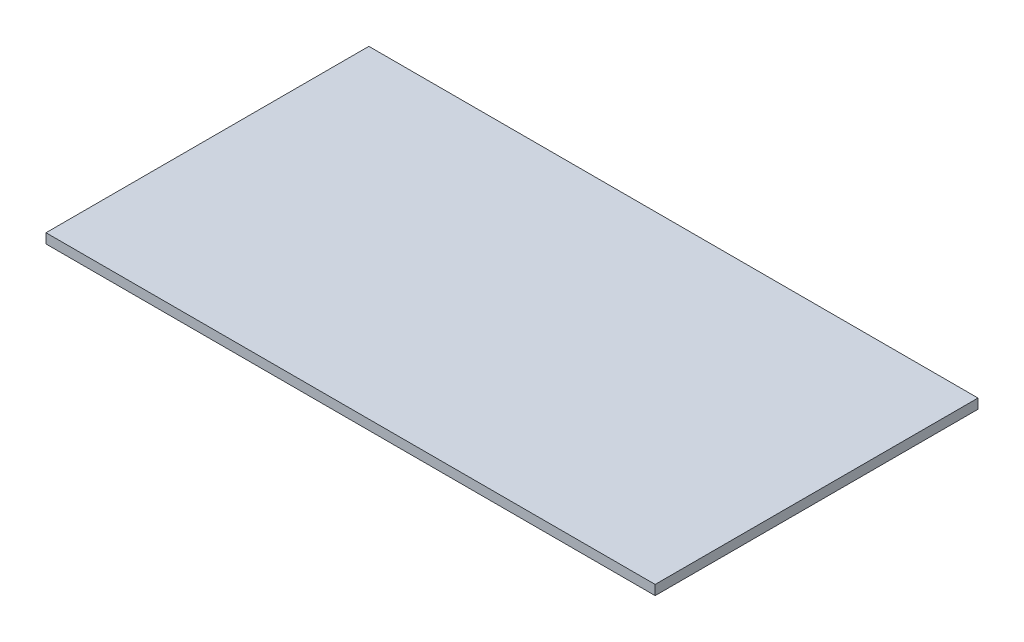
ISO-10303-21;
HEADER;
FILE_DESCRIPTION(('STEP AP214'),'2;1');
FILE_NAME('part.step','',(''),(''),'','','');
FILE_SCHEMA(('AUTOMOTIVE_DESIGN { 1 0 10303 214 1 1 1 1 }'));
ENDSEC;
DATA;
#1=APPLICATION_CONTEXT('core data for automotive mechanical design processes');
#2=APPLICATION_PROTOCOL_DEFINITION('international standard','automotive_design',2000,#1);
#3=PRODUCT_CONTEXT('',#1,'mechanical');
#4=PRODUCT('Part','Part','',(#3));
#5=PRODUCT_RELATED_PRODUCT_CATEGORY('part','',(#4));
#6=PRODUCT_DEFINITION_FORMATION('','',#4);
#7=PRODUCT_DEFINITION_CONTEXT('part definition',#1,'design');
#8=PRODUCT_DEFINITION('design','',#6,#7);
#9=PRODUCT_DEFINITION_SHAPE('','',#8);
#10=(LENGTH_UNIT() NAMED_UNIT(*) SI_UNIT(.MILLI.,.METRE.));
#11=(NAMED_UNIT(*) PLANE_ANGLE_UNIT() SI_UNIT($,.RADIAN.));
#12=(NAMED_UNIT(*) SI_UNIT($,.STERADIAN.) SOLID_ANGLE_UNIT());
#13=UNCERTAINTY_MEASURE_WITH_UNIT(LENGTH_MEASURE(1.E-05),#10,'distance_accuracy_value','');
#14=(GEOMETRIC_REPRESENTATION_CONTEXT(3) GLOBAL_UNCERTAINTY_ASSIGNED_CONTEXT((#13)) GLOBAL_UNIT_ASSIGNED_CONTEXT((#10,
#11,#12)) REPRESENTATION_CONTEXT('',''));
#15=CARTESIAN_POINT('',(0.,0.,0.));
#16=DIRECTION('',(0.,0.,1.));
#17=DIRECTION('',(1.,0.,0.));
#18=AXIS2_PLACEMENT_3D('',#15,#16,#17);
#19=CARTESIAN_POINT('',(500.,16.,265.));
#20=DIRECTION('',(-1.,0.,0.));
#21=DIRECTION('',(0.,0.,1.));
#22=AXIS2_PLACEMENT_3D('',#19,#20,#21);
#23=PLANE('',#22);
#24=DIRECTION('',(0.,0.,-1.));
#25=VECTOR('',#24,1.);
#26=CARTESIAN_POINT('',(500.,0.,265.));
#27=LINE('',#26,#25);
#28=CARTESIAN_POINT('',(500.,0.,265.));
#29=VERTEX_POINT('',#28);
#30=CARTESIAN_POINT('',(500.,0.,-265.));
#31=VERTEX_POINT('',#30);
#32=EDGE_CURVE('E96',#29,#31,#27,.T.);
#33=ORIENTED_EDGE('',*,*,#32,.T.);
#34=DIRECTION('',(0.,-1.,0.));
#35=VECTOR('',#34,1.);
#36=CARTESIAN_POINT('',(500.,16.,-265.));
#37=LINE('',#36,#35);
#38=CARTESIAN_POINT('',(500.,16.,-265.));
#39=VERTEX_POINT('',#38);
#40=EDGE_CURVE('E11',#39,#31,#37,.T.);
#41=ORIENTED_EDGE('',*,*,#40,.F.);
#42=DIRECTION('',(0.,0.,-1.));
#43=VECTOR('',#42,1.);
#44=CARTESIAN_POINT('',(500.,16.,265.));
#45=LINE('',#44,#43);
#46=CARTESIAN_POINT('',(500.,16.,265.));
#47=VERTEX_POINT('',#46);
#48=EDGE_CURVE('E84',#47,#39,#45,.T.);
#49=ORIENTED_EDGE('',*,*,#48,.F.);
#50=DIRECTION('',(0.,-1.,0.));
#51=VECTOR('',#50,1.);
#52=CARTESIAN_POINT('',(500.,16.,265.));
#53=LINE('',#52,#51);
#54=EDGE_CURVE('E92',#47,#29,#53,.T.);
#55=ORIENTED_EDGE('',*,*,#54,.T.);
#56=EDGE_LOOP('',(#33,#41,#49,#55));
#57=FACE_BOUND('',#56,.T.);
#58=ADVANCED_FACE('F33',(#57),#23,.F.);
#59=CARTESIAN_POINT('',(-500.,16.,-265.));
#60=DIRECTION('',(0.,0.,1.));
#61=DIRECTION('',(1.,0.,0.));
#62=AXIS2_PLACEMENT_3D('',#59,#60,#61);
#63=PLANE('',#62);
#64=DIRECTION('',(-1.,0.,0.));
#65=VECTOR('',#64,1.);
#66=CARTESIAN_POINT('',(-500.,0.,-265.));
#67=LINE('',#66,#65);
#68=CARTESIAN_POINT('',(-500.,0.,-265.));
#69=VERTEX_POINT('',#68);
#70=EDGE_CURVE('E88',#31,#69,#67,.T.);
#71=ORIENTED_EDGE('',*,*,#70,.T.);
#72=DIRECTION('',(0.,-1.,0.));
#73=VECTOR('',#72,1.);
#74=CARTESIAN_POINT('',(-500.,16.,-265.));
#75=LINE('',#74,#73);
#76=CARTESIAN_POINT('',(-500.,16.,-265.));
#77=VERTEX_POINT('',#76);
#78=EDGE_CURVE('E41',#77,#69,#75,.T.);
#79=ORIENTED_EDGE('',*,*,#78,.F.);
#80=DIRECTION('',(-1.,0.,0.));
#81=VECTOR('',#80,1.);
#82=CARTESIAN_POINT('',(-500.,16.,-265.));
#83=LINE('',#82,#81);
#84=EDGE_CURVE('E79',#39,#77,#83,.T.);
#85=ORIENTED_EDGE('',*,*,#84,.F.);
#86=ORIENTED_EDGE('',*,*,#40,.T.);
#87=EDGE_LOOP('',(#71,#79,#85,#86));
#88=FACE_BOUND('',#87,.T.);
#89=ADVANCED_FACE('F87',(#88),#63,.F.);
#90=CARTESIAN_POINT('',(-500.,16.,265.));
#91=DIRECTION('',(1.,0.,0.));
#92=DIRECTION('',(0.,0.,-1.));
#93=AXIS2_PLACEMENT_3D('',#90,#91,#92);
#94=PLANE('',#93);
#95=DIRECTION('',(0.,0.,1.));
#96=VECTOR('',#95,1.);
#97=CARTESIAN_POINT('',(-500.,0.,265.));
#98=LINE('',#97,#96);
#99=CARTESIAN_POINT('',(-500.,0.,265.));
#100=VERTEX_POINT('',#99);
#101=EDGE_CURVE('E66',#69,#100,#98,.T.);
#102=ORIENTED_EDGE('',*,*,#101,.T.);
#103=DIRECTION('',(0.,-1.,0.));
#104=VECTOR('',#103,1.);
#105=CARTESIAN_POINT('',(-500.,16.,265.));
#106=LINE('',#105,#104);
#107=CARTESIAN_POINT('',(-500.,16.,265.));
#108=VERTEX_POINT('',#107);
#109=EDGE_CURVE('E89',#108,#100,#106,.T.);
#110=ORIENTED_EDGE('',*,*,#109,.F.);
#111=DIRECTION('',(0.,0.,1.));
#112=VECTOR('',#111,1.);
#113=CARTESIAN_POINT('',(-500.,16.,265.));
#114=LINE('',#113,#112);
#115=EDGE_CURVE('E82',#77,#108,#114,.T.);
#116=ORIENTED_EDGE('',*,*,#115,.F.);
#117=ORIENTED_EDGE('',*,*,#78,.T.);
#118=EDGE_LOOP('',(#102,#110,#116,#117));
#119=FACE_BOUND('',#118,.T.);
#120=ADVANCED_FACE('F90',(#119),#94,.F.);
#121=CARTESIAN_POINT('',(-500.,16.,265.));
#122=DIRECTION('',(0.,0.,-1.));
#123=DIRECTION('',(-1.,0.,0.));
#124=AXIS2_PLACEMENT_3D('',#121,#122,#123);
#125=PLANE('',#124);
#126=DIRECTION('',(1.,0.,0.));
#127=VECTOR('',#126,1.);
#128=CARTESIAN_POINT('',(-500.,0.,265.));
#129=LINE('',#128,#127);
#130=EDGE_CURVE('E72',#100,#29,#129,.T.);
#131=ORIENTED_EDGE('',*,*,#130,.T.);
#132=ORIENTED_EDGE('',*,*,#54,.F.);
#133=DIRECTION('',(1.,0.,0.));
#134=VECTOR('',#133,1.);
#135=CARTESIAN_POINT('',(-500.,16.,265.));
#136=LINE('',#135,#134);
#137=EDGE_CURVE('E49',#108,#47,#136,.T.);
#138=ORIENTED_EDGE('',*,*,#137,.F.);
#139=ORIENTED_EDGE('',*,*,#109,.T.);
#140=EDGE_LOOP('',(#131,#132,#138,#139));
#141=FACE_BOUND('',#140,.T.);
#142=ADVANCED_FACE('F103',(#141),#125,.F.);
#143=CARTESIAN_POINT('',(0.,16.,0.));
#144=DIRECTION('',(0.,-1.,0.));
#145=DIRECTION('',(0.,0.,-1.));
#146=AXIS2_PLACEMENT_3D('',#143,#144,#145);
#147=PLANE('',#146);
#148=ORIENTED_EDGE('',*,*,#48,.T.);
#149=ORIENTED_EDGE('',*,*,#84,.T.);
#150=ORIENTED_EDGE('',*,*,#115,.T.);
#151=ORIENTED_EDGE('',*,*,#137,.T.);
#152=EDGE_LOOP('',(#148,#149,#150,#151));
#153=FACE_BOUND('',#152,.T.);
#154=ADVANCED_FACE('F80',(#153),#147,.F.);
#155=CARTESIAN_POINT('',(0.,0.,0.));
#156=DIRECTION('',(0.,-1.,0.));
#157=DIRECTION('',(0.,0.,-1.));
#158=AXIS2_PLACEMENT_3D('',#155,#156,#157);
#159=PLANE('',#158);
#160=ORIENTED_EDGE('',*,*,#32,.F.);
#161=ORIENTED_EDGE('',*,*,#130,.F.);
#162=ORIENTED_EDGE('',*,*,#101,.F.);
#163=ORIENTED_EDGE('',*,*,#70,.F.);
#164=EDGE_LOOP('',(#160,#161,#162,#163));
#165=FACE_BOUND('',#164,.T.);
#166=ADVANCED_FACE('F106',(#165),#159,.T.);
#167=CLOSED_SHELL('',(#58,#89,#120,#142,#154,#166));
#168=MANIFOLD_SOLID_BREP('B2',#167);
#169=ADVANCED_BREP_SHAPE_REPRESENTATION('',(#18,#168),#14);
#170=SHAPE_DEFINITION_REPRESENTATION(#9,#169);
ENDSEC;
END-ISO-10303-21;
